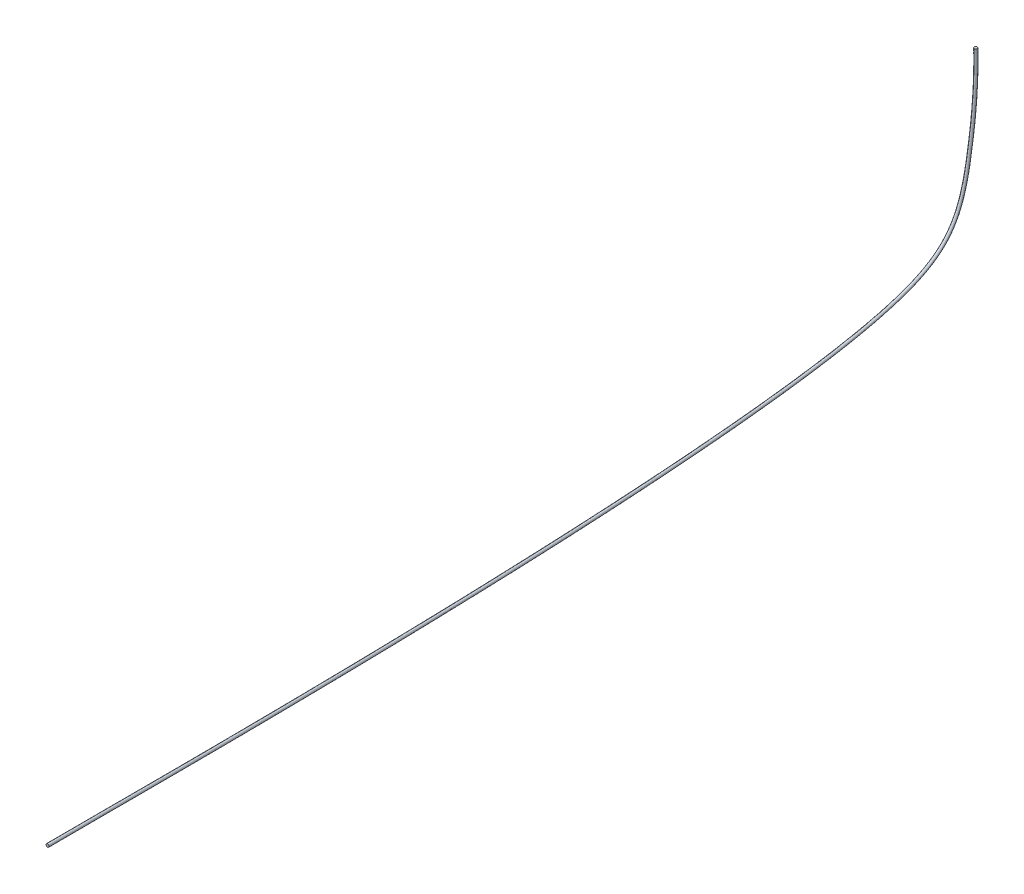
ISO-10303-21;
HEADER;
FILE_DESCRIPTION(('STEP AP214'),'2;1');
FILE_NAME('part.step','',(''),(''),'','','');
FILE_SCHEMA(('AUTOMOTIVE_DESIGN { 1 0 10303 214 1 1 1 1 }'));
ENDSEC;
DATA;
#1=APPLICATION_CONTEXT('core data for automotive mechanical design processes');
#2=APPLICATION_PROTOCOL_DEFINITION('international standard','automotive_design',2000,#1);
#3=PRODUCT_CONTEXT('',#1,'mechanical');
#4=PRODUCT('Part','Part','',(#3));
#5=PRODUCT_RELATED_PRODUCT_CATEGORY('part','',(#4));
#6=PRODUCT_DEFINITION_FORMATION('','',#4);
#7=PRODUCT_DEFINITION_CONTEXT('part definition',#1,'design');
#8=PRODUCT_DEFINITION('design','',#6,#7);
#9=PRODUCT_DEFINITION_SHAPE('','',#8);
#10=(LENGTH_UNIT() NAMED_UNIT(*) SI_UNIT(.MILLI.,.METRE.));
#11=(NAMED_UNIT(*) PLANE_ANGLE_UNIT() SI_UNIT($,.RADIAN.));
#12=(NAMED_UNIT(*) SI_UNIT($,.STERADIAN.) SOLID_ANGLE_UNIT());
#13=UNCERTAINTY_MEASURE_WITH_UNIT(LENGTH_MEASURE(1.E-05),#10,'distance_accuracy_value','');
#14=(GEOMETRIC_REPRESENTATION_CONTEXT(3) GLOBAL_UNCERTAINTY_ASSIGNED_CONTEXT((#13)) GLOBAL_UNIT_ASSIGNED_CONTEXT((#10,
#11,#12)) REPRESENTATION_CONTEXT('',''));
#15=CARTESIAN_POINT('',(0.,0.,0.));
#16=DIRECTION('',(0.,0.,1.));
#17=DIRECTION('',(1.,0.,0.));
#18=AXIS2_PLACEMENT_3D('',#15,#16,#17);
#19=CARTESIAN_POINT('',(0.,0.,-19.05));
#20=DIRECTION('',(0.,-1.,0.));
#21=DIRECTION('',(0.,0.,-1.));
#22=AXIS2_PLACEMENT_3D('',#19,#20,#21);
#23=PLANE('',#22);
#24=CARTESIAN_POINT('',(0.,0.,0.));
#25=DIRECTION('',(0.,1.,0.));
#26=DIRECTION('',(0.,0.,1.));
#27=AXIS2_PLACEMENT_3D('',#24,#25,#26);
#28=CIRCLE('',#27,19.05);
#29=CARTESIAN_POINT('',(0.,0.,19.05));
#30=VERTEX_POINT('',#29);
#31=EDGE_CURVE('E53',#30,#30,#28,.T.);
#32=ORIENTED_EDGE('',*,*,#31,.T.);
#33=EDGE_LOOP('',(#32));
#34=FACE_BOUND('',#33,.T.);
#35=ADVANCED_FACE('F49',(#34),#23,.F.);
#36=CARTESIAN_POINT('',(0.,-2899.4097874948,11794.4962234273));
#37=DIRECTION('',(0.,-0.00472336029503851,0.999988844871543));
#38=DIRECTION('',(0.,-0.999988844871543,-0.00472336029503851));
#39=AXIS2_PLACEMENT_3D('',#36,#37,#38);
#40=PLANE('',#39);
#41=CARTESIAN_POINT('',(0.,-2880.36,11794.586203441));
#42=DIRECTION('',(0.,-0.00472336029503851,0.999988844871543));
#43=DIRECTION('',(0.,-0.999988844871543,-0.00472336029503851));
#44=AXIS2_PLACEMENT_3D('',#41,#42,#43);
#45=CIRCLE('',#44,19.0500000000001);
#46=CARTESIAN_POINT('',(0.,-2899.4097874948,11794.4962234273));
#47=VERTEX_POINT('',#46);
#48=EDGE_CURVE('E11',#47,#47,#45,.T.);
#49=ORIENTED_EDGE('',*,*,#48,.T.);
#50=EDGE_LOOP('',(#49));
#51=FACE_BOUND('',#50,.T.);
#52=ADVANCED_FACE('F51',(#51),#40,.T.);
#53=CARTESIAN_POINT('',(0.,0.,19.05));
#54=CARTESIAN_POINT('',(0.,-326.015550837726,12.2006777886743));
#55=CARTESIAN_POINT('',(0.,-658.590239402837,37.512916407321));
#56=CARTESIAN_POINT('',(0.,-1098.05880647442,95.8412487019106));
#57=CARTESIAN_POINT('',(0.,-1374.87419944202,142.790823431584));
#58=CARTESIAN_POINT('',(0.,-1633.12575362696,222.317146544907));
#59=CARTESIAN_POINT('',(0.,-1814.50527089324,314.942483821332));
#60=CARTESIAN_POINT('',(0.,-1964.20349970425,441.154865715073));
#61=CARTESIAN_POINT('',(0.,-2106.41636039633,633.806525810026));
#62=CARTESIAN_POINT('',(0.,-2197.3191558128,840.233858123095));
#63=CARTESIAN_POINT('',(0.,-2285.70701207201,1110.73684723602));
#64=CARTESIAN_POINT('',(0.,-2367.96349502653,1426.26141148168));
#65=CARTESIAN_POINT('',(0.,-2517.46310866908,2238.05003145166));
#66=CARTESIAN_POINT('',(0.,-2717.58128651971,4123.87953590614));
#67=CARTESIAN_POINT('',(0.,-2825.21621684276,6918.68207491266));
#68=CARTESIAN_POINT('',(0.,-2857.69840097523,9485.52481910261));
#69=CARTESIAN_POINT('',(0.,-2859.34936535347,11111.5552651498));
#70=CARTESIAN_POINT('',(0.,-2858.5340667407,11685.4086705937));
#71=CARTESIAN_POINT('',(0.,-2861.3102125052,11794.6761834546));
#72=CARTESIAN_POINT('',(38.1,0.,19.05));
#73=CARTESIAN_POINT('',(38.1,-326.015550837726,12.2006777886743));
#74=CARTESIAN_POINT('',(38.1,-658.590239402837,37.512916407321));
#75=CARTESIAN_POINT('',(38.1,-1098.05880647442,95.8412487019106));
#76=CARTESIAN_POINT('',(38.1,-1374.87419944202,142.790823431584));
#77=CARTESIAN_POINT('',(38.1,-1633.12575362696,222.317146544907));
#78=CARTESIAN_POINT('',(38.1,-1814.50527089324,314.942483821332));
#79=CARTESIAN_POINT('',(38.1,-1964.20349970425,441.154865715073));
#80=CARTESIAN_POINT('',(38.1,-2106.41636039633,633.806525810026));
#81=CARTESIAN_POINT('',(38.1,-2197.3191558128,840.233858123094));
#82=CARTESIAN_POINT('',(38.1,-2285.70701207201,1110.73684723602));
#83=CARTESIAN_POINT('',(38.1,-2367.96349502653,1426.26141148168));
#84=CARTESIAN_POINT('',(38.1,-2517.46310866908,2238.05003145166));
#85=CARTESIAN_POINT('',(38.1,-2717.58128651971,4123.87953590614));
#86=CARTESIAN_POINT('',(38.1,-2825.21621684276,6918.68207491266));
#87=CARTESIAN_POINT('',(38.1,-2857.69840097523,9485.52481910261));
#88=CARTESIAN_POINT('',(38.1,-2859.34936535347,11111.5552651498));
#89=CARTESIAN_POINT('',(38.1,-2858.5340667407,11685.4086705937));
#90=CARTESIAN_POINT('',(38.1,-2861.3102125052,11794.6761834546));
#91=CARTESIAN_POINT('',(38.1,0.,-19.05));
#92=CARTESIAN_POINT('',(38.1,-328.005801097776,-25.769867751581));
#93=CARTESIAN_POINT('',(38.1,-663.04707230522,-0.29719196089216));
#94=CARTESIAN_POINT('',(38.1,-1104.87420598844,58.2513301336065));
#95=CARTESIAN_POINT('',(38.1,-1383.37167252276,105.568334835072));
#96=CARTESIAN_POINT('',(38.1,-1647.67682907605,186.886838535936));
#97=CARTESIAN_POINT('',(38.1,-1836.17221185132,283.169622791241));
#98=CARTESIAN_POINT('',(38.1,-1993.0656865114,415.695537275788));
#99=CARTESIAN_POINT('',(38.1,-2140.66043774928,616.338308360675));
#100=CARTESIAN_POINT('',(38.1,-2233.20871962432,827.298474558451));
#101=CARTESIAN_POINT('',(38.1,-2322.64286438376,1101.24119184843));
#102=CARTESIAN_POINT('',(38.1,-2405.42011656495,1419.14590878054));
#103=CARTESIAN_POINT('',(38.1,-2555.4043579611,2234.07892895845));
#104=CARTESIAN_POINT('',(38.1,-2755.66902345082,4122.49217506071));
#105=CARTESIAN_POINT('',(38.1,-2863.31938423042,6918.55485810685));
#106=CARTESIAN_POINT('',(38.1,-2895.79574308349,9486.00681210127));
#107=CARTESIAN_POINT('',(38.1,-2897.43804364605,11112.655349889));
#108=CARTESIAN_POINT('',(38.1,-2896.63000949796,11685.6553921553));
#109=CARTESIAN_POINT('',(38.1,-2899.4097874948,11794.4962234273));
#110=CARTESIAN_POINT('',(0.,0.,-19.05));
#111=CARTESIAN_POINT('',(0.,-328.005801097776,-25.7698677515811));
#112=CARTESIAN_POINT('',(0.,-663.047072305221,-0.297191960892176));
#113=CARTESIAN_POINT('',(0.,-1104.87420598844,58.2513301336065));
#114=CARTESIAN_POINT('',(0.,-1383.37167252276,105.568334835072));
#115=CARTESIAN_POINT('',(0.,-1647.67682907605,186.886838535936));
#116=CARTESIAN_POINT('',(0.,-1836.17221185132,283.169622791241));
#117=CARTESIAN_POINT('',(0.,-1993.0656865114,415.695537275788));
#118=CARTESIAN_POINT('',(0.,-2140.66043774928,616.338308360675));
#119=CARTESIAN_POINT('',(0.,-2233.20871962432,827.298474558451));
#120=CARTESIAN_POINT('',(0.,-2322.64286438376,1101.24119184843));
#121=CARTESIAN_POINT('',(0.,-2405.42011656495,1419.14590878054));
#122=CARTESIAN_POINT('',(0.,-2555.4043579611,2234.07892895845));
#123=CARTESIAN_POINT('',(0.,-2755.66902345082,4122.49217506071));
#124=CARTESIAN_POINT('',(0.,-2863.31938423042,6918.55485810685));
#125=CARTESIAN_POINT('',(0.,-2895.79574308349,9486.00681210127));
#126=CARTESIAN_POINT('',(0.,-2897.43804364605,11112.655349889));
#127=CARTESIAN_POINT('',(0.,-2896.63000949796,11685.6553921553));
#128=CARTESIAN_POINT('',(0.,-2899.4097874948,11794.4962234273));
#129=CARTESIAN_POINT('',(-38.1,0.,-19.05));
#130=CARTESIAN_POINT('',(-38.1,-328.005801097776,-25.769867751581));
#131=CARTESIAN_POINT('',(-38.1,-663.04707230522,-0.29719196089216));
#132=CARTESIAN_POINT('',(-38.1,-1104.87420598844,58.2513301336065));
#133=CARTESIAN_POINT('',(-38.1,-1383.37167252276,105.568334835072));
#134=CARTESIAN_POINT('',(-38.1,-1647.67682907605,186.886838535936));
#135=CARTESIAN_POINT('',(-38.1,-1836.17221185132,283.169622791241));
#136=CARTESIAN_POINT('',(-38.1,-1993.0656865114,415.695537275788));
#137=CARTESIAN_POINT('',(-38.1,-2140.66043774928,616.338308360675));
#138=CARTESIAN_POINT('',(-38.1,-2233.20871962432,827.298474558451));
#139=CARTESIAN_POINT('',(-38.1,-2322.64286438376,1101.24119184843));
#140=CARTESIAN_POINT('',(-38.1,-2405.42011656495,1419.14590878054));
#141=CARTESIAN_POINT('',(-38.1,-2555.4043579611,2234.07892895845));
#142=CARTESIAN_POINT('',(-38.1,-2755.66902345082,4122.49217506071));
#143=CARTESIAN_POINT('',(-38.1,-2863.31938423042,6918.55485810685));
#144=CARTESIAN_POINT('',(-38.1,-2895.79574308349,9486.00681210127));
#145=CARTESIAN_POINT('',(-38.1,-2897.43804364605,11112.655349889));
#146=CARTESIAN_POINT('',(-38.1,-2896.63000949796,11685.6553921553));
#147=CARTESIAN_POINT('',(-38.1,-2899.4097874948,11794.4962234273));
#148=CARTESIAN_POINT('',(-38.1,0.,19.05));
#149=CARTESIAN_POINT('',(-38.1,-326.015550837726,12.2006777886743));
#150=CARTESIAN_POINT('',(-38.1,-658.590239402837,37.512916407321));
#151=CARTESIAN_POINT('',(-38.1,-1098.05880647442,95.8412487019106));
#152=CARTESIAN_POINT('',(-38.1,-1374.87419944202,142.790823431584));
#153=CARTESIAN_POINT('',(-38.1,-1633.12575362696,222.317146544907));
#154=CARTESIAN_POINT('',(-38.1,-1814.50527089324,314.942483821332));
#155=CARTESIAN_POINT('',(-38.1,-1964.20349970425,441.154865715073));
#156=CARTESIAN_POINT('',(-38.1,-2106.41636039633,633.806525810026));
#157=CARTESIAN_POINT('',(-38.1,-2197.3191558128,840.233858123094));
#158=CARTESIAN_POINT('',(-38.1,-2285.70701207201,1110.73684723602));
#159=CARTESIAN_POINT('',(-38.1,-2367.96349502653,1426.26141148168));
#160=CARTESIAN_POINT('',(-38.1,-2517.46310866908,2238.05003145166));
#161=CARTESIAN_POINT('',(-38.1,-2717.58128651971,4123.87953590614));
#162=CARTESIAN_POINT('',(-38.1,-2825.21621684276,6918.68207491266));
#163=CARTESIAN_POINT('',(-38.1,-2857.69840097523,9485.52481910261));
#164=CARTESIAN_POINT('',(-38.1,-2859.34936535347,11111.5552651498));
#165=CARTESIAN_POINT('',(-38.1,-2858.5340667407,11685.4086705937));
#166=CARTESIAN_POINT('',(-38.1,-2861.3102125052,11794.6761834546));
#167=CARTESIAN_POINT('',(0.,0.,19.05));
#168=CARTESIAN_POINT('',(0.,-326.015550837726,12.2006777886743));
#169=CARTESIAN_POINT('',(0.,-658.590239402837,37.512916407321));
#170=CARTESIAN_POINT('',(0.,-1098.05880647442,95.8412487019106));
#171=CARTESIAN_POINT('',(0.,-1374.87419944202,142.790823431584));
#172=CARTESIAN_POINT('',(0.,-1633.12575362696,222.317146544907));
#173=CARTESIAN_POINT('',(0.,-1814.50527089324,314.942483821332));
#174=CARTESIAN_POINT('',(0.,-1964.20349970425,441.154865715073));
#175=CARTESIAN_POINT('',(0.,-2106.41636039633,633.806525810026));
#176=CARTESIAN_POINT('',(0.,-2197.3191558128,840.233858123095));
#177=CARTESIAN_POINT('',(0.,-2285.70701207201,1110.73684723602));
#178=CARTESIAN_POINT('',(0.,-2367.96349502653,1426.26141148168));
#179=CARTESIAN_POINT('',(0.,-2517.46310866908,2238.05003145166));
#180=CARTESIAN_POINT('',(0.,-2717.58128651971,4123.87953590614));
#181=CARTESIAN_POINT('',(0.,-2825.21621684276,6918.68207491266));
#182=CARTESIAN_POINT('',(0.,-2857.69840097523,9485.52481910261));
#183=CARTESIAN_POINT('',(0.,-2859.34936535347,11111.5552651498));
#184=CARTESIAN_POINT('',(0.,-2858.5340667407,11685.4086705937));
#185=CARTESIAN_POINT('',(0.,-2861.3102125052,11794.6761834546));
#186=(BOUNDED_SURFACE() B_SPLINE_SURFACE(3,3,((#53,#54,#55,#56,#57,#58,#59,#60,#61,#62,#63,#64,
#65,#66,#67,#68,#69,#70,#71),(#72,#73,#74,#75,#76,#77,#78,#79,#80,#81,#82,#83,#84,#85,#86,#87,
#88,#89,#90),(#91,#92,#93,#94,#95,#96,#97,#98,#99,#100,#101,#102,#103,#104,#105,#106,#107,#108,
#109),(#110,#111,#112,#113,#114,#115,#116,#117,#118,#119,#120,#121,#122,#123,#124,#125,#126,
#127,#128),(#129,#130,#131,#132,#133,#134,#135,#136,#137,#138,#139,#140,#141,#142,#143,#144,
#145,#146,#147),(#148,#149,#150,#151,#152,#153,#154,#155,#156,#157,#158,#159,#160,#161,#162,
#163,#164,#165,#166),(#167,#168,#169,#170,#171,#172,#173,#174,#175,#176,#177,#178,#179,#180,
#181,#182,#183,#184,#185)),.UNSPECIFIED.,.T.,.F.,.F.) B_SPLINE_SURFACE_WITH_KNOTS((4,3,4),(4,1,
1,1,1,1,1,1,1,1,1,1,1,1,1,1,4),(0.,0.5,1.),(0.,0.0625,0.0774583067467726,0.124999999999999,
0.156249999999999,0.1875,0.21875,0.25,0.293904,0.301360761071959,0.337808,0.381712,0.4852,0.67,
0.78,0.89,1.),.UNSPECIFIED.) GEOMETRIC_REPRESENTATION_ITEM() RATIONAL_B_SPLINE_SURFACE(((1.,1.,
1.,1.,1.,1.,1.,1.,1.,1.,1.,1.,1.,1.,1.,1.,1.,1.,1.),(0.333333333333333,0.333333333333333,
0.333333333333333,0.333333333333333,0.333333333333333,0.333333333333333,0.333333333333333,
0.333333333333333,0.333333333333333,0.333333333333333,0.333333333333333,0.333333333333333,
0.333333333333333,0.333333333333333,0.333333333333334,0.333333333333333,0.333333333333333,
0.333333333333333,0.333333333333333),(0.333333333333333,0.333333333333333,0.333333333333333,
0.333333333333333,0.333333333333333,0.333333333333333,0.333333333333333,0.333333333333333,
0.333333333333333,0.333333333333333,0.333333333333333,0.333333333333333,0.333333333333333,
0.333333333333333,0.333333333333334,0.333333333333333,0.333333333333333,0.333333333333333,
0.333333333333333),(1.,1.,1.,1.,1.,1.,1.,1.,1.,1.,1.,1.,1.,1.,1.,1.,1.,1.,1.),
(0.333333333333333,0.333333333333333,0.333333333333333,0.333333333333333,0.333333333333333,
0.333333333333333,0.333333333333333,0.333333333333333,0.333333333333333,0.333333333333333,
0.333333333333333,0.333333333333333,0.333333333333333,0.333333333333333,0.333333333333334,
0.333333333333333,0.333333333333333,0.333333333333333,0.333333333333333),(0.333333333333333,
0.333333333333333,0.333333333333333,0.333333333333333,0.333333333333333,0.333333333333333,
0.333333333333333,0.333333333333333,0.333333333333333,0.333333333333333,0.333333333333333,
0.333333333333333,0.333333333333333,0.333333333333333,0.333333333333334,0.333333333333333,
0.333333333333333,0.333333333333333,0.333333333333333),(1.,1.,1.,1.,1.,1.,1.,1.,1.,1.,1.,1.,1.,
1.,1.,1.,1.,1.,1.))) REPRESENTATION_ITEM('') SURFACE());
#187=ORIENTED_EDGE('',*,*,#31,.F.);
#188=EDGE_LOOP('',(#187));
#189=FACE_BOUND('',#188,.T.);
#190=ORIENTED_EDGE('',*,*,#48,.F.);
#191=EDGE_LOOP('',(#190));
#192=FACE_BOUND('',#191,.T.);
#193=ADVANCED_FACE('F63',(#189,#192),#186,.F.);
#194=CLOSED_SHELL('',(#35,#52,#193));
#195=MANIFOLD_SOLID_BREP('B2',#194);
#196=ADVANCED_BREP_SHAPE_REPRESENTATION('',(#18,#195),#14);
#197=SHAPE_DEFINITION_REPRESENTATION(#9,#196);
ENDSEC;
END-ISO-10303-21;
